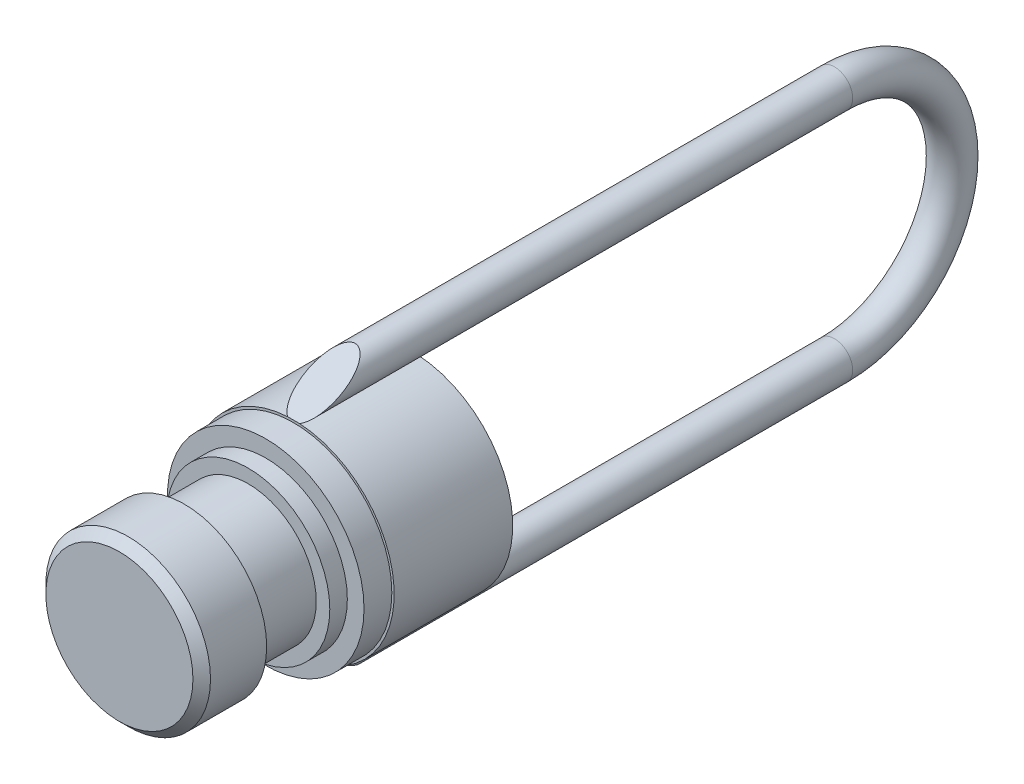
from build123d import *

# Parameters (mm, degrees)
SKETCH1_R          = 17.4625
EXTRUDE1_DEPTH     = 50.8
CHAMFER1_SIZE      = 1.524
SKETCH4_R          = 3.175
CUT_EXTRUDE1_DEPTH = 3.81


with BuildPart() as part:
    # Sketch1 → Extrude1 (new body)
    with BuildSketch(Plane.XY):
        Circle(SKETCH1_R)
    extrude(amount=-EXTRUDE1_DEPTH)

    # Sketch2 → Cut-Revolve1 (revolve, cut)
    with BuildSketch(Plane(origin=(0, 0, 0), x_dir=(0, 0, -1), z_dir=(1, 0, 0)), mode=Mode.PRIVATE) as cut_revolve1_sk:
        Polygon((12.7, 17.4625), (30.226, 17.4625), (30.226, 17.0561), (25.4, 17.0561), (25.4, 14.1605), (12.7, 14.1605), align=None)
    revolve(cut_revolve1_sk.sketch.rotate(Axis((0, 0, 2.059459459), (0, 0, -1)), 90), axis=Axis((0, 0, 2.059459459), (0, 0, -1)), mode=Mode.SUBTRACT)

    # Sketch3 → Cut-Revolve2 (revolve, cut)
    with BuildSketch(Plane(origin=(0, 0, 0), x_dir=(0, 0, -1), z_dir=(1, 0, 0)), mode=Mode.PRIVATE) as cut_revolve2_sk:
        Polygon((12.7, 11.811), (11.270192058, 14.2875), (0, 14.2875), (0, 17.4625), (22.352, 17.4625), (22.352, 11.811), align=None)
    revolve(cut_revolve2_sk.sketch.rotate(Axis((0, 0, 7.833791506), (0, 0, -1)), 90), axis=Axis((0, 0, 7.833791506), (0, 0, -1)), mode=Mode.SUBTRACT)

    # Chamfer1
    chamfer1_edges = [part.edges().sort_by_distance(p)[0] for p in [
        (-14.2875, 0, 0),
    ]]
    chamfer(chamfer1_edges, length=CHAMFER1_SIZE)

    # Sweep1: sweep along a path in Sketch5
    with BuildLine(Plane(origin=(0, 0, 0), x_dir=(0, 0, -1), z_dir=(1, 0, 0))) as sweep1_path:
        Line((30.226, 20.433149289), (124.092850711, 20.433149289))
        ThreePointArc((124.092850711, 20.433149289), (144.526, 0), (124.092850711, -20.433149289))
        Line((124.092850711, -20.433149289), (30.226, -20.433149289))
    # Sketch4 → Sweep1 (sweep)
    with BuildSketch(Plane.XY.offset(-30.226)):
        with Locations((0, 20.433149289)):
            Circle(SKETCH4_R)
    sweep(path=sweep1_path.line)

    # Sketch6 → Cut-Extrude1 (cut, symmetric)
    with BuildSketch(Plane(origin=(0, 0, 0), x_dir=(0, 0, -1), z_dir=(1, 0, 0))):
        Polygon((30.226, 17.431768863), (40.923804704, 23.608149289), (30.226, 23.608149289), align=None)
        Polygon((30.226, -23.608149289), (30.226, -17.431768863), (40.923804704, -23.608149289), align=None)
    extrude(amount=CUT_EXTRUDE1_DEPTH, both=True, mode=Mode.SUBTRACT)


solid = part.part
